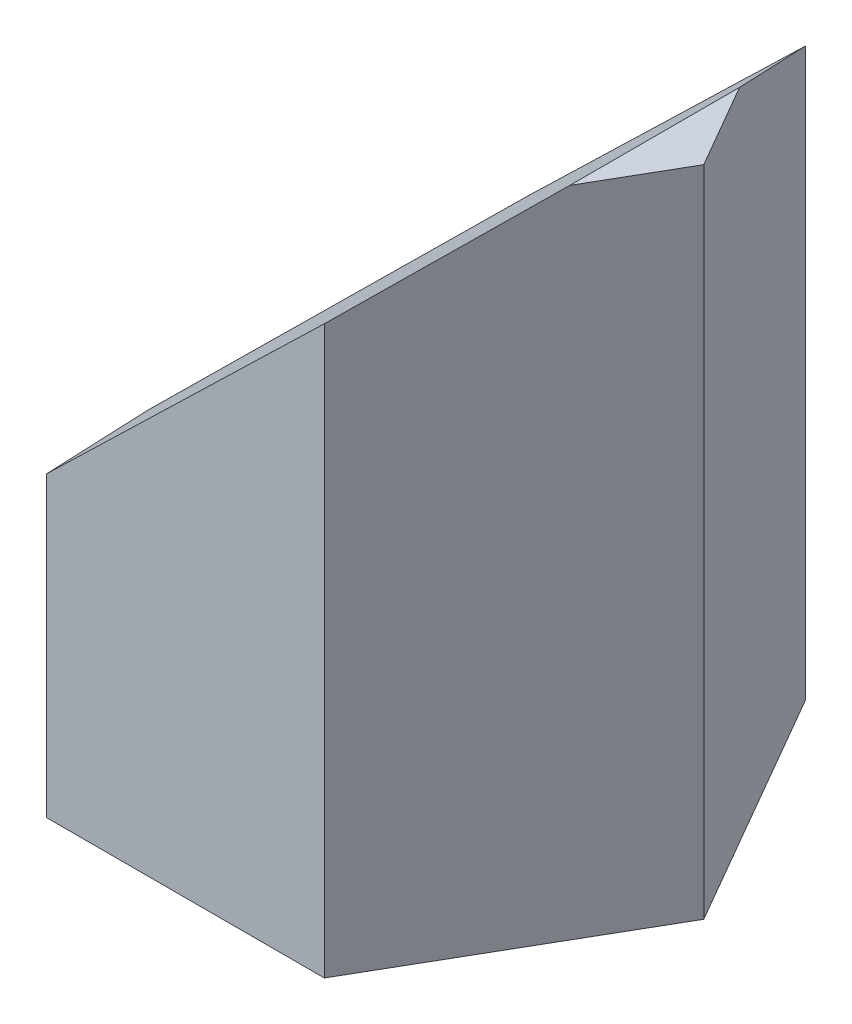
from build123d import *

# Parameters (mm, degrees)
EXTRUDE_1_DEPTH     = 40
CUT_EXTRUDE_1_DEPTH = 20


with BuildPart() as part:
    # Sketch 1 → Extrude 1 (new body)
    with BuildSketch(Plane(origin=(0, 0, 0), x_dir=(1, 0, 0), z_dir=(0, 1, 0))):
        Polygon((17, 0), (8.5, 14.722431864), (-8.5, 14.722431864), (-17, 0), (-8.5, -14.722431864), (8.5, -14.722431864), align=None)
    extrude(amount=EXTRUDE_1_DEPTH)

    # Sketch 2 → Cut-Extrude 1 (cut, symmetric)
    with BuildSketch(Plane.XY):
        Polygon((14, 40), (-17, 10), (-17, 40), align=None)
    extrude(amount=CUT_EXTRUDE_1_DEPTH, both=True, mode=Mode.SUBTRACT)


solid = part.part
